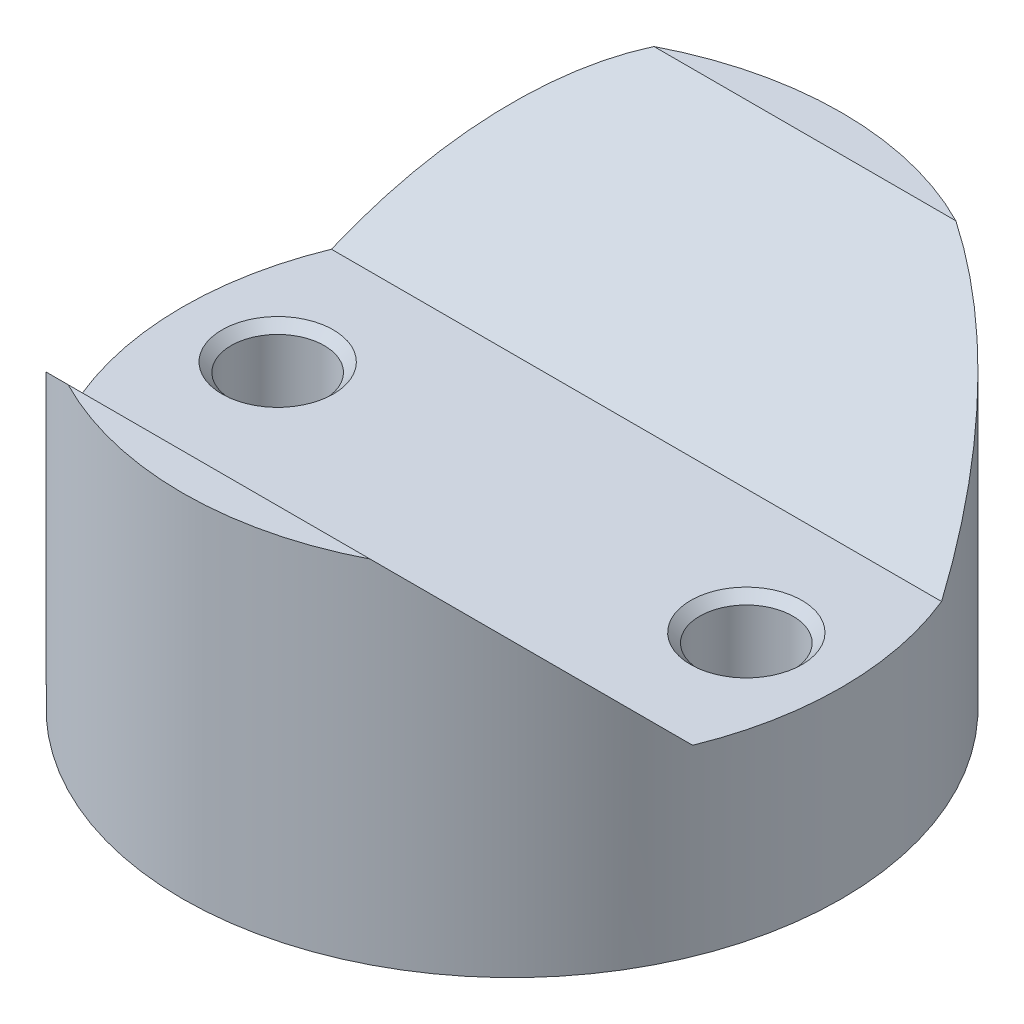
ISO-10303-21;
HEADER;
FILE_DESCRIPTION(('STEP AP214'),'2;1');
FILE_NAME('part.step','',(''),(''),'','','');
FILE_SCHEMA(('AUTOMOTIVE_DESIGN { 1 0 10303 214 1 1 1 1 }'));
ENDSEC;
DATA;
#1=APPLICATION_CONTEXT('core data for automotive mechanical design processes');
#2=APPLICATION_PROTOCOL_DEFINITION('international standard','automotive_design',2000,#1);
#3=PRODUCT_CONTEXT('',#1,'mechanical');
#4=PRODUCT('Part','Part','',(#3));
#5=PRODUCT_RELATED_PRODUCT_CATEGORY('part','',(#4));
#6=PRODUCT_DEFINITION_FORMATION('','',#4);
#7=PRODUCT_DEFINITION_CONTEXT('part definition',#1,'design');
#8=PRODUCT_DEFINITION('design','',#6,#7);
#9=PRODUCT_DEFINITION_SHAPE('','',#8);
#10=(LENGTH_UNIT() NAMED_UNIT(*) SI_UNIT(.MILLI.,.METRE.));
#11=(NAMED_UNIT(*) PLANE_ANGLE_UNIT() SI_UNIT($,.RADIAN.));
#12=(NAMED_UNIT(*) SI_UNIT($,.STERADIAN.) SOLID_ANGLE_UNIT());
#13=UNCERTAINTY_MEASURE_WITH_UNIT(LENGTH_MEASURE(1.E-05),#10,'distance_accuracy_value','');
#14=(GEOMETRIC_REPRESENTATION_CONTEXT(3) GLOBAL_UNCERTAINTY_ASSIGNED_CONTEXT((#13)) GLOBAL_UNIT_ASSIGNED_CONTEXT((#10,
#11,#12)) REPRESENTATION_CONTEXT('',''));
#15=CARTESIAN_POINT('',(0.,0.,0.));
#16=DIRECTION('',(0.,0.,1.));
#17=DIRECTION('',(1.,0.,0.));
#18=AXIS2_PLACEMENT_3D('',#15,#16,#17);
#19=CARTESIAN_POINT('',(0.,15.24,0.));
#20=DIRECTION('',(0.,1.,0.));
#21=DIRECTION('',(0.,0.,1.));
#22=AXIS2_PLACEMENT_3D('',#19,#20,#21);
#23=PLANE('',#22);
#24=DIRECTION('',(1.,0.,0.));
#25=VECTOR('',#24,1.);
#26=CARTESIAN_POINT('',(0.,15.24,12.7));
#27=LINE('',#26,#25);
#28=CARTESIAN_POINT('',(-6.54543018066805,15.24,12.7));
#29=VERTEX_POINT('',#28);
#30=CARTESIAN_POINT('',(6.54543018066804,15.24,12.7));
#31=VERTEX_POINT('',#30);
#32=EDGE_CURVE('E58',#29,#31,#27,.T.);
#33=ORIENTED_EDGE('',*,*,#32,.F.);
#34=CARTESIAN_POINT('',(0.,15.24,0.));
#35=DIRECTION('',(0.,1.,0.));
#36=DIRECTION('',(0.,0.,1.));
#37=AXIS2_PLACEMENT_3D('',#34,#35,#36);
#38=CIRCLE('',#37,14.2875);
#39=EDGE_CURVE('E92',#29,#31,#38,.T.);
#40=ORIENTED_EDGE('',*,*,#39,.T.);
#41=EDGE_LOOP('',(#33,#40));
#42=FACE_BOUND('',#41,.T.);
#43=ADVANCED_FACE('F35',(#42),#23,.T.);
#44=CARTESIAN_POINT('',(0.,15.24,0.));
#45=DIRECTION('',(0.,-1.,0.));
#46=DIRECTION('',(0.,0.,-1.));
#47=AXIS2_PLACEMENT_3D('',#44,#45,#46);
#48=CYLINDRICAL_SURFACE('',#47,14.2875);
#49=CARTESIAN_POINT('',(6.54543018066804,15.24,-12.7));
#50=VERTEX_POINT('',#49);
#51=CARTESIAN_POINT('',(-6.54543018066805,15.24,-12.7));
#52=VERTEX_POINT('',#51);
#53=EDGE_CURVE('E82',#50,#52,#38,.T.);
#54=ORIENTED_EDGE('',*,*,#53,.F.);
#55=CARTESIAN_POINT('',(0.,2.54000000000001,0.));
#56=DIRECTION('',(0.,-0.707106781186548,-0.707106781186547));
#57=DIRECTION('',(0.,-0.707106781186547,0.707106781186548));
#58=AXIS2_PLACEMENT_3D('',#55,#56,#57);
#59=ELLIPSE('',#58,20.2055762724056,14.2875);
#60=CARTESIAN_POINT('',(13.2287433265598,7.9375,-5.39749999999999));
#61=VERTEX_POINT('',#60);
#62=EDGE_CURVE('E50',#50,#61,#59,.T.);
#63=ORIENTED_EDGE('',*,*,#62,.T.);
#64=CARTESIAN_POINT('',(0.,7.9375,0.));
#65=DIRECTION('',(0.,-1.,0.));
#66=DIRECTION('',(0.,0.,-1.));
#67=AXIS2_PLACEMENT_3D('',#64,#65,#66);
#68=CIRCLE('',#67,14.2875);
#69=CARTESIAN_POINT('',(13.2287433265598,7.9375,5.39749999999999));
#70=VERTEX_POINT('',#69);
#71=EDGE_CURVE('E100',#61,#70,#68,.T.);
#72=ORIENTED_EDGE('',*,*,#71,.T.);
#73=CARTESIAN_POINT('',(0.,2.54000000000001,0.));
#74=DIRECTION('',(0.,-0.707106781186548,0.707106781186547));
#75=DIRECTION('',(0.,-0.707106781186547,-0.707106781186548));
#76=AXIS2_PLACEMENT_3D('',#73,#74,#75);
#77=ELLIPSE('',#76,20.2055762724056,14.2875);
#78=EDGE_CURVE('E191',#70,#31,#77,.T.);
#79=ORIENTED_EDGE('',*,*,#78,.T.);
#80=ORIENTED_EDGE('',*,*,#39,.F.);
#81=CARTESIAN_POINT('',(-13.2287433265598,7.9375,5.39749999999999));
#82=VERTEX_POINT('',#81);
#83=EDGE_CURVE('E89',#29,#82,#77,.T.);
#84=ORIENTED_EDGE('',*,*,#83,.T.);
#85=CARTESIAN_POINT('',(-13.2287433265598,7.9375,-5.39749999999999));
#86=VERTEX_POINT('',#85);
#87=EDGE_CURVE('E88',#82,#86,#68,.T.);
#88=ORIENTED_EDGE('',*,*,#87,.T.);
#89=EDGE_CURVE('E77',#86,#52,#59,.T.);
#90=ORIENTED_EDGE('',*,*,#89,.T.);
#91=EDGE_LOOP('',(#54,#63,#72,#79,#80,#84,#88,#90));
#92=FACE_BOUND('',#91,.T.);
#93=CARTESIAN_POINT('',(0.,0.,0.));
#94=DIRECTION('',(0.,1.,0.));
#95=DIRECTION('',(0.,0.,1.));
#96=AXIS2_PLACEMENT_3D('',#93,#94,#95);
#97=CIRCLE('',#96,14.2875);
#98=CARTESIAN_POINT('',(0.,0.,14.2875));
#99=VERTEX_POINT('',#98);
#100=EDGE_CURVE('E95',#99,#99,#97,.T.);
#101=ORIENTED_EDGE('',*,*,#100,.T.);
#102=EDGE_LOOP('',(#101));
#103=FACE_BOUND('',#102,.T.);
#104=ADVANCED_FACE('F37',(#92,#103),#48,.T.);
#105=DIRECTION('',(-1.,0.,0.));
#106=VECTOR('',#105,1.);
#107=CARTESIAN_POINT('',(0.,15.24,-12.7));
#108=LINE('',#107,#106);
#109=EDGE_CURVE('E74',#50,#52,#108,.T.);
#110=ORIENTED_EDGE('',*,*,#109,.F.);
#111=ORIENTED_EDGE('',*,*,#53,.T.);
#112=EDGE_LOOP('',(#110,#111));
#113=FACE_BOUND('',#112,.T.);
#114=ADVANCED_FACE('F91',(#113),#23,.T.);
#115=CARTESIAN_POINT('',(0.,0.,0.));
#116=DIRECTION('',(0.,1.,0.));
#117=DIRECTION('',(0.,0.,1.));
#118=AXIS2_PLACEMENT_3D('',#115,#116,#117);
#119=PLANE('',#118);
#120=CARTESIAN_POINT('',(0.,0.,0.));
#121=DIRECTION('',(0.,-1.,0.));
#122=DIRECTION('',(0.,0.,-1.));
#123=AXIS2_PLACEMENT_3D('',#120,#121,#122);
#124=CIRCLE('',#123,6.35);
#125=CARTESIAN_POINT('',(0.,0.,-6.35));
#126=VERTEX_POINT('',#125);
#127=EDGE_CURVE('E202',#126,#126,#124,.T.);
#128=ORIENTED_EDGE('',*,*,#127,.F.);
#129=EDGE_LOOP('',(#128));
#130=FACE_BOUND('',#129,.T.);
#131=CARTESIAN_POINT('',(10.16,0.,0.));
#132=DIRECTION('',(0.,1.,0.));
#133=DIRECTION('',(0.,0.,1.));
#134=AXIS2_PLACEMENT_3D('',#131,#132,#133);
#135=CIRCLE('',#134,2.41299999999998);
#136=CARTESIAN_POINT('',(10.16,0.,2.41299999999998));
#137=VERTEX_POINT('',#136);
#138=EDGE_CURVE('E118',#137,#137,#135,.T.);
#139=ORIENTED_EDGE('',*,*,#138,.T.);
#140=EDGE_LOOP('',(#139));
#141=FACE_BOUND('',#140,.T.);
#142=CARTESIAN_POINT('',(-10.16,0.,0.));
#143=DIRECTION('',(0.,1.,0.));
#144=DIRECTION('',(0.,0.,1.));
#145=AXIS2_PLACEMENT_3D('',#142,#143,#144);
#146=CIRCLE('',#145,2.41299999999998);
#147=CARTESIAN_POINT('',(-10.16,0.,2.41299999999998));
#148=VERTEX_POINT('',#147);
#149=EDGE_CURVE('E115',#148,#148,#146,.T.);
#150=ORIENTED_EDGE('',*,*,#149,.T.);
#151=EDGE_LOOP('',(#150));
#152=FACE_BOUND('',#151,.T.);
#153=ORIENTED_EDGE('',*,*,#100,.F.);
#154=EDGE_LOOP('',(#153));
#155=FACE_BOUND('',#154,.T.);
#156=ADVANCED_FACE('F150',(#130,#141,#152,#155),#119,.F.);
#157=CARTESIAN_POINT('',(-14.2875,7.9375,-5.3975));
#158=DIRECTION('',(0.,-1.,0.));
#159=DIRECTION('',(0.,0.,-1.));
#160=AXIS2_PLACEMENT_3D('',#157,#158,#159);
#161=PLANE('',#160);
#162=CARTESIAN_POINT('',(10.16,7.9375,0.));
#163=DIRECTION('',(0.,-1.,0.));
#164=DIRECTION('',(0.,0.,-1.));
#165=AXIS2_PLACEMENT_3D('',#162,#163,#164);
#166=CIRCLE('',#165,2.413);
#167=CARTESIAN_POINT('',(10.16,7.9375,2.413));
#168=VERTEX_POINT('',#167);
#169=EDGE_CURVE('E106',#168,#168,#166,.T.);
#170=ORIENTED_EDGE('',*,*,#169,.T.);
#171=EDGE_LOOP('',(#170));
#172=FACE_BOUND('',#171,.T.);
#173=CARTESIAN_POINT('',(-10.16,7.9375,0.));
#174=DIRECTION('',(0.,-1.,0.));
#175=DIRECTION('',(0.,0.,-1.));
#176=AXIS2_PLACEMENT_3D('',#173,#174,#175);
#177=CIRCLE('',#176,2.413);
#178=CARTESIAN_POINT('',(-10.16,7.9375,2.413));
#179=VERTEX_POINT('',#178);
#180=EDGE_CURVE('E103',#179,#179,#177,.T.);
#181=ORIENTED_EDGE('',*,*,#180,.T.);
#182=EDGE_LOOP('',(#181));
#183=FACE_BOUND('',#182,.T.);
#184=DIRECTION('',(1.,0.,0.));
#185=VECTOR('',#184,1.);
#186=CARTESIAN_POINT('',(-14.2875,7.9375,-5.3975));
#187=LINE('',#186,#185);
#188=EDGE_CURVE('E194',#86,#61,#187,.T.);
#189=ORIENTED_EDGE('',*,*,#188,.F.);
#190=ORIENTED_EDGE('',*,*,#87,.F.);
#191=DIRECTION('',(1.,0.,0.));
#192=VECTOR('',#191,1.);
#193=CARTESIAN_POINT('',(-14.2875,7.9375,5.3975));
#194=LINE('',#193,#192);
#195=EDGE_CURVE('E195',#82,#70,#194,.T.);
#196=ORIENTED_EDGE('',*,*,#195,.T.);
#197=ORIENTED_EDGE('',*,*,#71,.F.);
#198=EDGE_LOOP('',(#189,#190,#196,#197));
#199=FACE_BOUND('',#198,.T.);
#200=ADVANCED_FACE('F154',(#172,#183,#199),#161,.F.);
#201=CARTESIAN_POINT('',(-14.2875,7.9375,5.3975));
#202=DIRECTION('',(0.,-0.707106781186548,0.707106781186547));
#203=DIRECTION('',(0.,-0.707106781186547,-0.707106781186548));
#204=AXIS2_PLACEMENT_3D('',#201,#202,#203);
#205=PLANE('',#204);
#206=ORIENTED_EDGE('',*,*,#195,.F.);
#207=ORIENTED_EDGE('',*,*,#83,.F.);
#208=ORIENTED_EDGE('',*,*,#32,.T.);
#209=ORIENTED_EDGE('',*,*,#78,.F.);
#210=EDGE_LOOP('',(#206,#207,#208,#209));
#211=FACE_BOUND('',#210,.T.);
#212=ADVANCED_FACE('F159',(#211),#205,.F.);
#213=CARTESIAN_POINT('',(-14.2875,15.24,-12.7));
#214=DIRECTION('',(0.,-0.707106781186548,-0.707106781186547));
#215=DIRECTION('',(0.,0.707106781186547,-0.707106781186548));
#216=AXIS2_PLACEMENT_3D('',#213,#214,#215);
#217=PLANE('',#216);
#218=ORIENTED_EDGE('',*,*,#188,.T.);
#219=ORIENTED_EDGE('',*,*,#62,.F.);
#220=ORIENTED_EDGE('',*,*,#109,.T.);
#221=ORIENTED_EDGE('',*,*,#89,.F.);
#222=EDGE_LOOP('',(#218,#219,#220,#221));
#223=FACE_BOUND('',#222,.T.);
#224=ADVANCED_FACE('F76',(#223),#217,.F.);
#225=CARTESIAN_POINT('',(10.16,0.,0.));
#226=DIRECTION('',(0.,-1.,0.));
#227=DIRECTION('',(0.,0.,-1.));
#228=AXIS2_PLACEMENT_3D('',#225,#226,#227);
#229=CYLINDRICAL_SURFACE('',#228,2.01929999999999);
#230=CARTESIAN_POINT('',(10.16,7.54379999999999,0.));
#231=DIRECTION('',(0.,-1.,0.));
#232=DIRECTION('',(0.,0.,-1.));
#233=AXIS2_PLACEMENT_3D('',#230,#231,#232);
#234=CIRCLE('',#233,2.01929999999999);
#235=CARTESIAN_POINT('',(10.16,7.54379999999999,2.01929999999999));
#236=VERTEX_POINT('',#235);
#237=EDGE_CURVE('E112',#236,#236,#234,.F.);
#238=ORIENTED_EDGE('',*,*,#237,.T.);
#239=EDGE_LOOP('',(#238));
#240=FACE_BOUND('',#239,.T.);
#241=CARTESIAN_POINT('',(10.16,0.393699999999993,0.));
#242=DIRECTION('',(0.,1.,0.));
#243=DIRECTION('',(0.,0.,1.));
#244=AXIS2_PLACEMENT_3D('',#241,#242,#243);
#245=CIRCLE('',#244,2.01929999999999);
#246=CARTESIAN_POINT('',(10.16,0.393699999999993,2.01929999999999));
#247=VERTEX_POINT('',#246);
#248=EDGE_CURVE('E109',#247,#247,#245,.F.);
#249=ORIENTED_EDGE('',*,*,#248,.T.);
#250=EDGE_LOOP('',(#249));
#251=FACE_BOUND('',#250,.T.);
#252=ADVANCED_FACE('F168',(#240,#251),#229,.F.);
#253=CARTESIAN_POINT('',(-10.16,0.,0.));
#254=DIRECTION('',(0.,-1.,0.));
#255=DIRECTION('',(0.,0.,-1.));
#256=AXIS2_PLACEMENT_3D('',#253,#254,#255);
#257=CYLINDRICAL_SURFACE('',#256,2.01929999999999);
#258=CARTESIAN_POINT('',(-10.16,7.54379999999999,0.));
#259=DIRECTION('',(0.,-1.,0.));
#260=DIRECTION('',(0.,0.,-1.));
#261=AXIS2_PLACEMENT_3D('',#258,#259,#260);
#262=CIRCLE('',#261,2.01929999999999);
#263=CARTESIAN_POINT('',(-10.16,7.54379999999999,2.01929999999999));
#264=VERTEX_POINT('',#263);
#265=EDGE_CURVE('E11',#264,#264,#262,.F.);
#266=ORIENTED_EDGE('',*,*,#265,.T.);
#267=EDGE_LOOP('',(#266));
#268=FACE_BOUND('',#267,.T.);
#269=CARTESIAN_POINT('',(-10.16,0.393699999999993,0.));
#270=DIRECTION('',(0.,1.,0.));
#271=DIRECTION('',(0.,0.,1.));
#272=AXIS2_PLACEMENT_3D('',#269,#270,#271);
#273=CIRCLE('',#272,2.01929999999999);
#274=CARTESIAN_POINT('',(-10.16,0.393699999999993,2.01929999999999));
#275=VERTEX_POINT('',#274);
#276=EDGE_CURVE('E43',#275,#275,#273,.F.);
#277=ORIENTED_EDGE('',*,*,#276,.T.);
#278=EDGE_LOOP('',(#277));
#279=FACE_BOUND('',#278,.T.);
#280=ADVANCED_FACE('F123',(#268,#279),#257,.F.);
#281=CARTESIAN_POINT('',(10.16,7.9375,0.));
#282=DIRECTION('',(0.,1.,0.));
#283=DIRECTION('',(0.,0.,1.));
#284=AXIS2_PLACEMENT_3D('',#281,#282,#283);
#285=CONICAL_SURFACE('',#284,2.413,0.785398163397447);
#286=CARTESIAN_POINT('',(10.16,7.54379999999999,2.01929999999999));
#287=CARTESIAN_POINT('',(10.16,7.54790104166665,2.02340104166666));
#288=CARTESIAN_POINT('',(10.16,7.55200208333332,2.02750208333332));
#289=CARTESIAN_POINT('',(10.16,7.56020416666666,2.03570416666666));
#290=CARTESIAN_POINT('',(10.16,7.56430520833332,2.03980520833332));
#291=CARTESIAN_POINT('',(10.16,7.57250729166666,2.04800729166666));
#292=CARTESIAN_POINT('',(10.16,7.57660833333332,2.05210833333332));
#293=CARTESIAN_POINT('',(10.16,7.58481041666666,2.06031041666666));
#294=CARTESIAN_POINT('',(10.16,7.58891145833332,2.06441145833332));
#295=CARTESIAN_POINT('',(10.16,7.59711354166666,2.07261354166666));
#296=CARTESIAN_POINT('',(10.16,7.60121458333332,2.07671458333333));
#297=CARTESIAN_POINT('',(10.16,7.60941666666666,2.08491666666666));
#298=CARTESIAN_POINT('',(10.16,7.61351770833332,2.08901770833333));
#299=CARTESIAN_POINT('',(10.16,7.62171979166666,2.09721979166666));
#300=CARTESIAN_POINT('',(10.16,7.62582083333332,2.10132083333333));
#301=CARTESIAN_POINT('',(10.16,7.63402291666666,2.10952291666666));
#302=CARTESIAN_POINT('',(10.16,7.63812395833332,2.11362395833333));
#303=CARTESIAN_POINT('',(10.16,7.64632604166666,2.12182604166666));
#304=CARTESIAN_POINT('',(10.16,7.65042708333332,2.12592708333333));
#305=CARTESIAN_POINT('',(10.16,7.65862916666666,2.13412916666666));
#306=CARTESIAN_POINT('',(10.16,7.66273020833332,2.13823020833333));
#307=CARTESIAN_POINT('',(10.16,7.67093229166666,2.14643229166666));
#308=CARTESIAN_POINT('',(10.16,7.67503333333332,2.15053333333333));
#309=CARTESIAN_POINT('',(10.16,7.68323541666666,2.15873541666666));
#310=CARTESIAN_POINT('',(10.16,7.68733645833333,2.16283645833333));
#311=CARTESIAN_POINT('',(10.16,7.69553854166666,2.17103854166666));
#312=CARTESIAN_POINT('',(10.16,7.69963958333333,2.17513958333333));
#313=CARTESIAN_POINT('',(10.16,7.70784166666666,2.18334166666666));
#314=CARTESIAN_POINT('',(10.16,7.71194270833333,2.18744270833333));
#315=CARTESIAN_POINT('',(10.16,7.72014479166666,2.19564479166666));
#316=CARTESIAN_POINT('',(10.16,7.72424583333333,2.19974583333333));
#317=CARTESIAN_POINT('',(10.16,7.73244791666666,2.20794791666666));
#318=CARTESIAN_POINT('',(10.16,7.73654895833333,2.21204895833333));
#319=CARTESIAN_POINT('',(10.16,7.74475104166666,2.22025104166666));
#320=CARTESIAN_POINT('',(10.16,7.74885208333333,2.22435208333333));
#321=CARTESIAN_POINT('',(10.16,7.75705416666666,2.23255416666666));
#322=CARTESIAN_POINT('',(10.16,7.76115520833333,2.23665520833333));
#323=CARTESIAN_POINT('',(10.16,7.76935729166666,2.24485729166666));
#324=CARTESIAN_POINT('',(10.16,7.77345833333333,2.24895833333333));
#325=CARTESIAN_POINT('',(10.16,7.78166041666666,2.25716041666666));
#326=CARTESIAN_POINT('',(10.16,7.78576145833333,2.26126145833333));
#327=CARTESIAN_POINT('',(10.16,7.79396354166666,2.26946354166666));
#328=CARTESIAN_POINT('',(10.16,7.79806458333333,2.27356458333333));
#329=CARTESIAN_POINT('',(10.16,7.80626666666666,2.28176666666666));
#330=CARTESIAN_POINT('',(10.16,7.81036770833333,2.28586770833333));
#331=CARTESIAN_POINT('',(10.16,7.81856979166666,2.29406979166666));
#332=CARTESIAN_POINT('',(10.16,7.82267083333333,2.29817083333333));
#333=CARTESIAN_POINT('',(10.16,7.83087291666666,2.30637291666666));
#334=CARTESIAN_POINT('',(10.16,7.83497395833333,2.31047395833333));
#335=CARTESIAN_POINT('',(10.16,7.84317604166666,2.31867604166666));
#336=CARTESIAN_POINT('',(10.16,7.84727708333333,2.32277708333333));
#337=CARTESIAN_POINT('',(10.16,7.85547916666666,2.33097916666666));
#338=CARTESIAN_POINT('',(10.16,7.85958020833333,2.33508020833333));
#339=CARTESIAN_POINT('',(10.16,7.86778229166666,2.34328229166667));
#340=CARTESIAN_POINT('',(10.16,7.87188333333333,2.34738333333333));
#341=CARTESIAN_POINT('',(10.16,7.88008541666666,2.35558541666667));
#342=CARTESIAN_POINT('',(10.16,7.88418645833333,2.35968645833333));
#343=CARTESIAN_POINT('',(10.16,7.89238854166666,2.36788854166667));
#344=CARTESIAN_POINT('',(10.16,7.89648958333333,2.37198958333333));
#345=CARTESIAN_POINT('',(10.16,7.90469166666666,2.38019166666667));
#346=CARTESIAN_POINT('',(10.16,7.90879270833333,2.38429270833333));
#347=CARTESIAN_POINT('',(10.16,7.91699479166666,2.39249479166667));
#348=CARTESIAN_POINT('',(10.16,7.92109583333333,2.39659583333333));
#349=CARTESIAN_POINT('',(10.16,7.92929791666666,2.40479791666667));
#350=CARTESIAN_POINT('',(10.16,7.93339895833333,2.40889895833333));
#351=CARTESIAN_POINT('',(10.16,7.9375,2.413));
#352=B_SPLINE_CURVE_WITH_KNOTS('',3,(#286,#287,#288,#289,#290,#291,#292,#293,#294,#295,#296,
#297,#298,#299,#300,#301,#302,#303,#304,#305,#306,#307,#308,#309,#310,#311,#312,#313,#314,#315,
#316,#317,#318,#319,#320,#321,#322,#323,#324,#325,#326,#327,#328,#329,#330,#331,#332,#333,#334,
#335,#336,#337,#338,#339,#340,#341,#342,#343,#344,#345,#346,#347,#348,#349,#350,#351),
.UNSPECIFIED.,.F.,.F.,(4,2,2,2,2,2,2,2,2,2,2,2,2,2,2,2,2,2,2,2,2,2,2,2,2,2,2,2,2,2,2,2,4),(0.,
0.0173992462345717,0.0347984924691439,0.0521977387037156,0.0695969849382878,0.0869962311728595,
0.104395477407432,0.121794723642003,0.139193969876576,0.156593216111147,0.17399246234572,
0.191391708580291,0.208790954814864,0.226190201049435,0.243589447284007,0.260988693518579,
0.278387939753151,0.295787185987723,0.313186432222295,0.330585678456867,0.347984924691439,
0.36538417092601,0.382783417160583,0.400182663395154,0.417581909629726,0.434981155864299,
0.452380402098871,0.469779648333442,0.487178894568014,0.504578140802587,0.521977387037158,
0.53937663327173,0.556775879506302),.UNSPECIFIED.);
#353=EDGE_CURVE('BSEAM174',#236,#168,#352,.T.);
#354=ORIENTED_EDGE('',*,*,#237,.F.);
#355=ORIENTED_EDGE('',*,*,#169,.F.);
#356=ORIENTED_EDGE('',*,*,#353,.T.);
#357=ORIENTED_EDGE('',*,*,#353,.F.);
#358=EDGE_LOOP('',(#354,#356,#355,#357));
#359=FACE_BOUND('',#358,.T.);
#360=ADVANCED_FACE('F174',(#359),#285,.F.);
#361=CARTESIAN_POINT('',(10.16,0.393699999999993,0.));
#362=DIRECTION('',(0.,-1.,0.));
#363=DIRECTION('',(0.,0.,-1.));
#364=AXIS2_PLACEMENT_3D('',#361,#362,#363);
#365=CONICAL_SURFACE('',#364,2.01929999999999,0.785398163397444);
#366=ORIENTED_EDGE('',*,*,#138,.F.);
#367=EDGE_LOOP('',(#366));
#368=FACE_BOUND('',#367,.T.);
#369=ORIENTED_EDGE('',*,*,#248,.F.);
#370=EDGE_LOOP('',(#369));
#371=FACE_BOUND('',#370,.T.);
#372=ADVANCED_FACE('F139',(#368,#371),#365,.F.);
#373=CARTESIAN_POINT('',(-10.16,7.9375,0.));
#374=DIRECTION('',(0.,1.,0.));
#375=DIRECTION('',(0.,0.,1.));
#376=AXIS2_PLACEMENT_3D('',#373,#374,#375);
#377=CONICAL_SURFACE('',#376,2.413,0.785398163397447);
#378=CARTESIAN_POINT('',(-10.16,7.54379999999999,2.01929999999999));
#379=CARTESIAN_POINT('',(-10.16,7.54790104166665,2.02340104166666));
#380=CARTESIAN_POINT('',(-10.16,7.55200208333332,2.02750208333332));
#381=CARTESIAN_POINT('',(-10.16,7.56020416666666,2.03570416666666));
#382=CARTESIAN_POINT('',(-10.16,7.56430520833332,2.03980520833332));
#383=CARTESIAN_POINT('',(-10.16,7.57250729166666,2.04800729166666));
#384=CARTESIAN_POINT('',(-10.16,7.57660833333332,2.05210833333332));
#385=CARTESIAN_POINT('',(-10.16,7.58481041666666,2.06031041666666));
#386=CARTESIAN_POINT('',(-10.16,7.58891145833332,2.06441145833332));
#387=CARTESIAN_POINT('',(-10.16,7.59711354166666,2.07261354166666));
#388=CARTESIAN_POINT('',(-10.16,7.60121458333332,2.07671458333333));
#389=CARTESIAN_POINT('',(-10.16,7.60941666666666,2.08491666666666));
#390=CARTESIAN_POINT('',(-10.16,7.61351770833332,2.08901770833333));
#391=CARTESIAN_POINT('',(-10.16,7.62171979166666,2.09721979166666));
#392=CARTESIAN_POINT('',(-10.16,7.62582083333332,2.10132083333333));
#393=CARTESIAN_POINT('',(-10.16,7.63402291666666,2.10952291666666));
#394=CARTESIAN_POINT('',(-10.16,7.63812395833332,2.11362395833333));
#395=CARTESIAN_POINT('',(-10.16,7.64632604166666,2.12182604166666));
#396=CARTESIAN_POINT('',(-10.16,7.65042708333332,2.12592708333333));
#397=CARTESIAN_POINT('',(-10.16,7.65862916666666,2.13412916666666));
#398=CARTESIAN_POINT('',(-10.16,7.66273020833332,2.13823020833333));
#399=CARTESIAN_POINT('',(-10.16,7.67093229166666,2.14643229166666));
#400=CARTESIAN_POINT('',(-10.16,7.67503333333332,2.15053333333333));
#401=CARTESIAN_POINT('',(-10.16,7.68323541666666,2.15873541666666));
#402=CARTESIAN_POINT('',(-10.16,7.68733645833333,2.16283645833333));
#403=CARTESIAN_POINT('',(-10.16,7.69553854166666,2.17103854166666));
#404=CARTESIAN_POINT('',(-10.16,7.69963958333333,2.17513958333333));
#405=CARTESIAN_POINT('',(-10.16,7.70784166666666,2.18334166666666));
#406=CARTESIAN_POINT('',(-10.16,7.71194270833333,2.18744270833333));
#407=CARTESIAN_POINT('',(-10.16,7.72014479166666,2.19564479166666));
#408=CARTESIAN_POINT('',(-10.16,7.72424583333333,2.19974583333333));
#409=CARTESIAN_POINT('',(-10.16,7.73244791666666,2.20794791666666));
#410=CARTESIAN_POINT('',(-10.16,7.73654895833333,2.21204895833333));
#411=CARTESIAN_POINT('',(-10.16,7.74475104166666,2.22025104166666));
#412=CARTESIAN_POINT('',(-10.16,7.74885208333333,2.22435208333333));
#413=CARTESIAN_POINT('',(-10.16,7.75705416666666,2.23255416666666));
#414=CARTESIAN_POINT('',(-10.16,7.76115520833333,2.23665520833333));
#415=CARTESIAN_POINT('',(-10.16,7.76935729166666,2.24485729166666));
#416=CARTESIAN_POINT('',(-10.16,7.77345833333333,2.24895833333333));
#417=CARTESIAN_POINT('',(-10.16,7.78166041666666,2.25716041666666));
#418=CARTESIAN_POINT('',(-10.16,7.78576145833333,2.26126145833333));
#419=CARTESIAN_POINT('',(-10.16,7.79396354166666,2.26946354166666));
#420=CARTESIAN_POINT('',(-10.16,7.79806458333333,2.27356458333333));
#421=CARTESIAN_POINT('',(-10.16,7.80626666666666,2.28176666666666));
#422=CARTESIAN_POINT('',(-10.16,7.81036770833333,2.28586770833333));
#423=CARTESIAN_POINT('',(-10.16,7.81856979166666,2.29406979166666));
#424=CARTESIAN_POINT('',(-10.16,7.82267083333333,2.29817083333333));
#425=CARTESIAN_POINT('',(-10.16,7.83087291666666,2.30637291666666));
#426=CARTESIAN_POINT('',(-10.16,7.83497395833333,2.31047395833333));
#427=CARTESIAN_POINT('',(-10.16,7.84317604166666,2.31867604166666));
#428=CARTESIAN_POINT('',(-10.16,7.84727708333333,2.32277708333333));
#429=CARTESIAN_POINT('',(-10.16,7.85547916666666,2.33097916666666));
#430=CARTESIAN_POINT('',(-10.16,7.85958020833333,2.33508020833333));
#431=CARTESIAN_POINT('',(-10.16,7.86778229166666,2.34328229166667));
#432=CARTESIAN_POINT('',(-10.16,7.87188333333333,2.34738333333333));
#433=CARTESIAN_POINT('',(-10.16,7.88008541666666,2.35558541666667));
#434=CARTESIAN_POINT('',(-10.16,7.88418645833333,2.35968645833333));
#435=CARTESIAN_POINT('',(-10.16,7.89238854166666,2.36788854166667));
#436=CARTESIAN_POINT('',(-10.16,7.89648958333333,2.37198958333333));
#437=CARTESIAN_POINT('',(-10.16,7.90469166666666,2.38019166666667));
#438=CARTESIAN_POINT('',(-10.16,7.90879270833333,2.38429270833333));
#439=CARTESIAN_POINT('',(-10.16,7.91699479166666,2.39249479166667));
#440=CARTESIAN_POINT('',(-10.16,7.92109583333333,2.39659583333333));
#441=CARTESIAN_POINT('',(-10.16,7.92929791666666,2.40479791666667));
#442=CARTESIAN_POINT('',(-10.16,7.93339895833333,2.40889895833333));
#443=CARTESIAN_POINT('',(-10.16,7.9375,2.413));
#444=B_SPLINE_CURVE_WITH_KNOTS('',3,(#378,#379,#380,#381,#382,#383,#384,#385,#386,#387,#388,
#389,#390,#391,#392,#393,#394,#395,#396,#397,#398,#399,#400,#401,#402,#403,#404,#405,#406,#407,
#408,#409,#410,#411,#412,#413,#414,#415,#416,#417,#418,#419,#420,#421,#422,#423,#424,#425,#426,
#427,#428,#429,#430,#431,#432,#433,#434,#435,#436,#437,#438,#439,#440,#441,#442,#443),
.UNSPECIFIED.,.F.,.F.,(4,2,2,2,2,2,2,2,2,2,2,2,2,2,2,2,2,2,2,2,2,2,2,2,2,2,2,2,2,2,2,2,4),(0.,
0.0173992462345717,0.0347984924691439,0.0521977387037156,0.0695969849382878,0.0869962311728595,
0.104395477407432,0.121794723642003,0.139193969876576,0.156593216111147,0.17399246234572,
0.191391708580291,0.208790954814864,0.226190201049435,0.243589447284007,0.260988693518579,
0.278387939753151,0.295787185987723,0.313186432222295,0.330585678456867,0.347984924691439,
0.36538417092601,0.382783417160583,0.400182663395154,0.417581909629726,0.434981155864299,
0.452380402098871,0.469779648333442,0.487178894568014,0.504578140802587,0.521977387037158,
0.53937663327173,0.556775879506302),.UNSPECIFIED.);
#445=EDGE_CURVE('BSEAM128',#264,#179,#444,.T.);
#446=ORIENTED_EDGE('',*,*,#265,.F.);
#447=ORIENTED_EDGE('',*,*,#180,.F.);
#448=ORIENTED_EDGE('',*,*,#445,.T.);
#449=ORIENTED_EDGE('',*,*,#445,.F.);
#450=EDGE_LOOP('',(#446,#448,#447,#449));
#451=FACE_BOUND('',#450,.T.);
#452=ADVANCED_FACE('F128',(#451),#377,.F.);
#453=CARTESIAN_POINT('',(-10.16,0.393699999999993,0.));
#454=DIRECTION('',(0.,-1.,0.));
#455=DIRECTION('',(0.,0.,-1.));
#456=AXIS2_PLACEMENT_3D('',#453,#454,#455);
#457=CONICAL_SURFACE('',#456,2.01929999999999,0.785398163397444);
#458=ORIENTED_EDGE('',*,*,#149,.F.);
#459=EDGE_LOOP('',(#458));
#460=FACE_BOUND('',#459,.T.);
#461=ORIENTED_EDGE('',*,*,#276,.F.);
#462=EDGE_LOOP('',(#461));
#463=FACE_BOUND('',#462,.T.);
#464=ADVANCED_FACE('F125',(#460,#463),#457,.F.);
#465=CARTESIAN_POINT('',(0.,0.635,0.));
#466=DIRECTION('',(0.,-1.,0.));
#467=DIRECTION('',(0.,0.,-1.));
#468=AXIS2_PLACEMENT_3D('',#465,#466,#467);
#469=CYLINDRICAL_SURFACE('',#468,6.35);
#470=CARTESIAN_POINT('',(0.,0.635,0.));
#471=DIRECTION('',(0.,-1.,0.));
#472=DIRECTION('',(0.,0.,-1.));
#473=AXIS2_PLACEMENT_3D('',#470,#471,#472);
#474=CIRCLE('',#473,6.35);
#475=CARTESIAN_POINT('',(0.,0.635,-6.35));
#476=VERTEX_POINT('',#475);
#477=EDGE_CURVE('E198',#476,#476,#474,.T.);
#478=ORIENTED_EDGE('',*,*,#477,.F.);
#479=EDGE_LOOP('',(#478));
#480=FACE_BOUND('',#479,.T.);
#481=ORIENTED_EDGE('',*,*,#127,.T.);
#482=EDGE_LOOP('',(#481));
#483=FACE_BOUND('',#482,.T.);
#484=ADVANCED_FACE('F127',(#480,#483),#469,.F.);
#485=CARTESIAN_POINT('',(0.,0.635,0.));
#486=DIRECTION('',(0.,-1.,0.));
#487=DIRECTION('',(0.,0.,-1.));
#488=AXIS2_PLACEMENT_3D('',#485,#486,#487);
#489=PLANE('',#488);
#490=ORIENTED_EDGE('',*,*,#477,.T.);
#491=EDGE_LOOP('',(#490));
#492=FACE_BOUND('',#491,.T.);
#493=ADVANCED_FACE('F136',(#492),#489,.T.);
#494=CLOSED_SHELL('',(#43,#104,#114,#156,#200,#212,#224,#252,#280,#360,#372,#452,#464,#484,#493));
#495=MANIFOLD_SOLID_BREP('B2',#494);
#496=ADVANCED_BREP_SHAPE_REPRESENTATION('',(#18,#495),#14);
#497=SHAPE_DEFINITION_REPRESENTATION(#9,#496);
ENDSEC;
END-ISO-10303-21;
